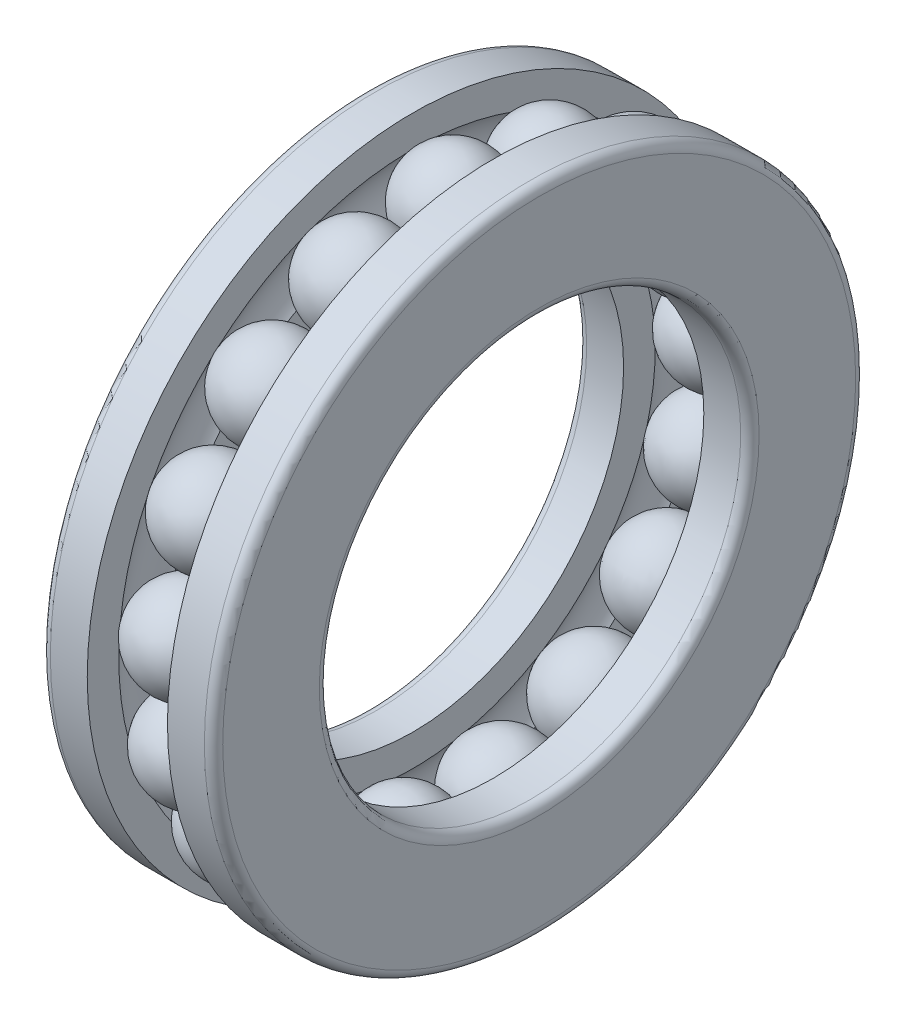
from build123d import *

# Parameters (mm, degrees)
BALLSDETAILED_COUNT = 17
BALLSDETAILED_ANGLE = 338.823529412


with BuildPart() as part:
    # InnRacSke → Race (revolve)
    with BuildSketch(Plane.XY, mode=Mode.PRIVATE) as race_sk:
        with BuildLine():
            Line((-6.6468625, 40.158083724), (-6.6468625, 34.925))
            Line((-6.6468625, 34.925), (-12.7635, 34.925))
            ThreePointArc((-12.7635, 34.925), (-13.841130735, 35.371369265), (-14.2875, 36.449))
            Line((-14.2875, 36.449), (-14.2875, 52.451))
            ThreePointArc((-14.2875, 52.451), (-13.841130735, 53.528630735), (-12.7635, 53.975))
            Line((-12.7635, 53.975), (-6.6468625, 53.975))
            Line((-6.6468625, 53.975), (-6.6468625, 48.741916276))
            ThreePointArc((-6.6468625, 48.741916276), (-7.9121, 44.45), (-6.6468625, 40.158083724))
        make_face()
    race = revolve(race_sk.sketch.rotate(Axis((-34.925, 0, 0), (1, 0, 0)), 270), axis=Axis((-34.925, 0, 0), (1, 0, 0)))

    # BalDetSke → BallDetailed (revolve)
    with BuildSketch(Plane.XY):
        with BuildLine():
            Line((-7.9375, 44.45), (7.9375, 44.45))
            ThreePointArc((7.9375, 44.45), (0, 36.5125), (-7.9375, 44.45))
        make_face()
    balldetailed = revolve(axis=Axis((-14.57325, 44.45, 0), (1, 0, 0)))

    # Mirror1: Race across plane
    add(race.mirror(Plane(origin=(0, 0, 0), x_dir=(0, 0, 1), z_dir=(1, 0, 0))))

    # BallsDetailed: BallDetailed ×17 about axis
    ballsdetailed_axis = Axis((-50, 0, 0), (1, 0, 0))
    for i in range(1, BALLSDETAILED_COUNT):
        add(balldetailed.rotate(ballsdetailed_axis, i * BALLSDETAILED_ANGLE / (BALLSDETAILED_COUNT - 1)))


solid = part.part
